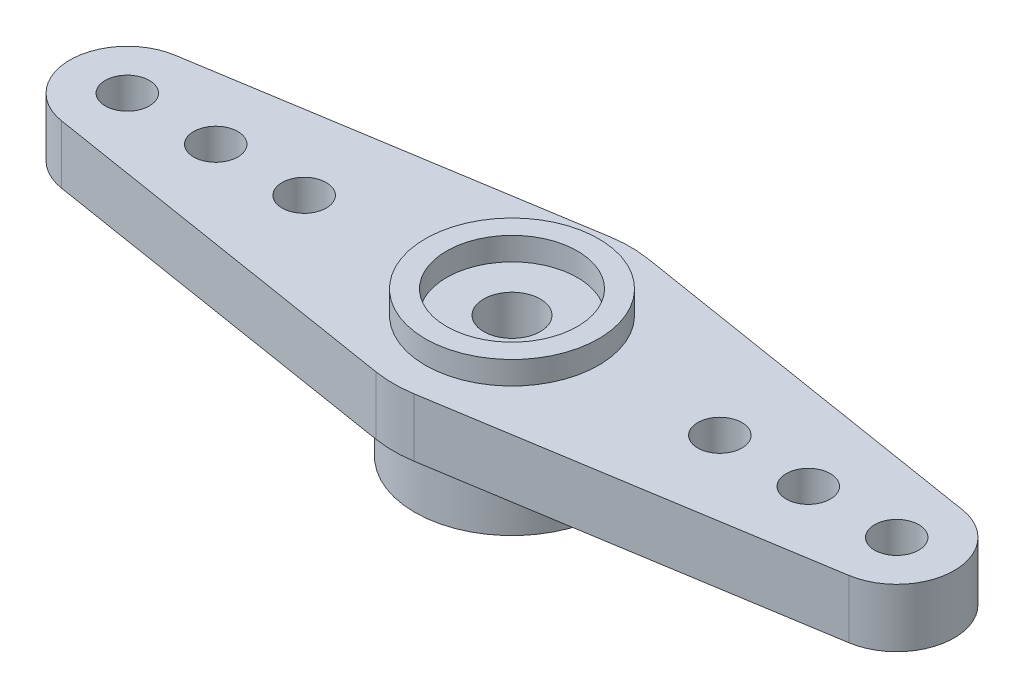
ISO-10303-21;
HEADER;
FILE_DESCRIPTION(('STEP AP214'),'2;1');
FILE_NAME('part.step','',(''),(''),'','','');
FILE_SCHEMA(('AUTOMOTIVE_DESIGN { 1 0 10303 214 1 1 1 1 }'));
ENDSEC;
DATA;
#1=APPLICATION_CONTEXT('core data for automotive mechanical design processes');
#2=APPLICATION_PROTOCOL_DEFINITION('international standard','automotive_design',2000,#1);
#3=PRODUCT_CONTEXT('',#1,'mechanical');
#4=PRODUCT('Part','Part','',(#3));
#5=PRODUCT_RELATED_PRODUCT_CATEGORY('part','',(#4));
#6=PRODUCT_DEFINITION_FORMATION('','',#4);
#7=PRODUCT_DEFINITION_CONTEXT('part definition',#1,'design');
#8=PRODUCT_DEFINITION('design','',#6,#7);
#9=PRODUCT_DEFINITION_SHAPE('','',#8);
#10=(LENGTH_UNIT() NAMED_UNIT(*) SI_UNIT(.MILLI.,.METRE.));
#11=(NAMED_UNIT(*) PLANE_ANGLE_UNIT() SI_UNIT($,.RADIAN.));
#12=(NAMED_UNIT(*) SI_UNIT($,.STERADIAN.) SOLID_ANGLE_UNIT());
#13=UNCERTAINTY_MEASURE_WITH_UNIT(LENGTH_MEASURE(1.E-05),#10,'distance_accuracy_value','');
#14=(GEOMETRIC_REPRESENTATION_CONTEXT(3) GLOBAL_UNCERTAINTY_ASSIGNED_CONTEXT((#13)) GLOBAL_UNIT_ASSIGNED_CONTEXT((#10,
#11,#12)) REPRESENTATION_CONTEXT('',''));
#15=CARTESIAN_POINT('',(0.,0.,0.));
#16=DIRECTION('',(0.,0.,1.));
#17=DIRECTION('',(1.,0.,0.));
#18=AXIS2_PLACEMENT_3D('',#15,#16,#17);
#19=CARTESIAN_POINT('',(0.,3.3,0.));
#20=DIRECTION('',(0.,1.,0.));
#21=DIRECTION('',(0.,0.,1.));
#22=AXIS2_PLACEMENT_3D('',#19,#20,#21);
#23=PLANE('',#22);
#24=CARTESIAN_POINT('',(-16.75,3.3,0.));
#25=DIRECTION('',(0.,1.,0.));
#26=DIRECTION('',(0.,0.,1.));
#27=AXIS2_PLACEMENT_3D('',#24,#25,#26);
#28=CIRCLE('',#27,1.25);
#29=CARTESIAN_POINT('',(-16.75,3.3,1.25));
#30=VERTEX_POINT('',#29);
#31=EDGE_CURVE('E195',#30,#30,#28,.T.);
#32=ORIENTED_EDGE('',*,*,#31,.F.);
#33=EDGE_LOOP('',(#32));
#34=FACE_BOUND('',#33,.T.);
#35=CARTESIAN_POINT('',(11.75,3.3,0.));
#36=DIRECTION('',(0.,1.,0.));
#37=DIRECTION('',(0.,0.,1.));
#38=AXIS2_PLACEMENT_3D('',#35,#36,#37);
#39=CIRCLE('',#38,1.25);
#40=CARTESIAN_POINT('',(11.75,3.3,1.25));
#41=VERTEX_POINT('',#40);
#42=EDGE_CURVE('E207',#41,#41,#39,.T.);
#43=ORIENTED_EDGE('',*,*,#42,.F.);
#44=EDGE_LOOP('',(#43));
#45=FACE_BOUND('',#44,.T.);
#46=CARTESIAN_POINT('',(21.75,3.3,0.));
#47=DIRECTION('',(0.,1.,0.));
#48=DIRECTION('',(0.,0.,1.));
#49=AXIS2_PLACEMENT_3D('',#46,#47,#48);
#50=CIRCLE('',#49,1.25);
#51=CARTESIAN_POINT('',(21.75,3.3,1.25));
#52=VERTEX_POINT('',#51);
#53=EDGE_CURVE('E219',#52,#52,#50,.T.);
#54=ORIENTED_EDGE('',*,*,#53,.F.);
#55=EDGE_LOOP('',(#54));
#56=FACE_BOUND('',#55,.T.);
#57=CARTESIAN_POINT('',(0.,3.3,0.));
#58=DIRECTION('',(0.,1.,0.));
#59=DIRECTION('',(0.,0.,1.));
#60=AXIS2_PLACEMENT_3D('',#57,#58,#59);
#61=CIRCLE('',#60,6.7);
#62=CARTESIAN_POINT('',(-1.06275862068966,3.3,6.61517528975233));
#63=VERTEX_POINT('',#62);
#64=CARTESIAN_POINT('',(1.06275862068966,3.3,6.61517528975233));
#65=VERTEX_POINT('',#64);
#66=EDGE_CURVE('E148',#63,#65,#61,.T.);
#67=ORIENTED_EDGE('',*,*,#66,.T.);
#68=DIRECTION('',(0.987339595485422,0.,-0.158620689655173));
#69=VECTOR('',#68,1.);
#70=CARTESIAN_POINT('',(1.06275862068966,3.3,6.61517528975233));
#71=LINE('',#70,#69);
#72=CARTESIAN_POINT('',(22.2655172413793,3.3,3.20885368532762));
#73=VERTEX_POINT('',#72);
#74=EDGE_CURVE('E96',#65,#73,#71,.T.);
#75=ORIENTED_EDGE('',*,*,#74,.T.);
#76=CARTESIAN_POINT('',(21.75,3.3,0.));
#77=DIRECTION('',(0.,1.,0.));
#78=DIRECTION('',(0.,0.,1.));
#79=AXIS2_PLACEMENT_3D('',#76,#77,#78);
#80=CIRCLE('',#79,3.25);
#81=CARTESIAN_POINT('',(22.2655172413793,3.3,-3.20885368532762));
#82=VERTEX_POINT('',#81);
#83=EDGE_CURVE('E228',#73,#82,#80,.T.);
#84=ORIENTED_EDGE('',*,*,#83,.T.);
#85=DIRECTION('',(-0.987339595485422,0.,-0.158620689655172));
#86=VECTOR('',#85,1.);
#87=CARTESIAN_POINT('',(22.2655172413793,3.3,-3.20885368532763));
#88=LINE('',#87,#86);
#89=CARTESIAN_POINT('',(1.06275862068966,3.3,-6.61517528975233));
#90=VERTEX_POINT('',#89);
#91=EDGE_CURVE('E230',#82,#90,#88,.T.);
#92=ORIENTED_EDGE('',*,*,#91,.T.);
#93=CARTESIAN_POINT('',(0.,3.3,0.));
#94=DIRECTION('',(0.,1.,0.));
#95=DIRECTION('',(0.,0.,1.));
#96=AXIS2_PLACEMENT_3D('',#93,#94,#95);
#97=CIRCLE('',#96,6.7);
#98=CARTESIAN_POINT('',(-1.06275862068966,3.3,-6.61517528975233));
#99=VERTEX_POINT('',#98);
#100=EDGE_CURVE('E115',#90,#99,#97,.T.);
#101=ORIENTED_EDGE('',*,*,#100,.T.);
#102=DIRECTION('',(-0.987339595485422,0.,0.158620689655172));
#103=VECTOR('',#102,1.);
#104=CARTESIAN_POINT('',(-22.2655172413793,3.3,-3.20885368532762));
#105=LINE('',#104,#103);
#106=CARTESIAN_POINT('',(-22.2655172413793,3.3,-3.20885368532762));
#107=VERTEX_POINT('',#106);
#108=EDGE_CURVE('E109',#99,#107,#105,.T.);
#109=ORIENTED_EDGE('',*,*,#108,.T.);
#110=CARTESIAN_POINT('',(-21.75,3.3,0.));
#111=DIRECTION('',(0.,1.,0.));
#112=DIRECTION('',(0.,0.,1.));
#113=AXIS2_PLACEMENT_3D('',#110,#111,#112);
#114=CIRCLE('',#113,3.25);
#115=CARTESIAN_POINT('',(-22.2655172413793,3.3,3.20885368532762));
#116=VERTEX_POINT('',#115);
#117=EDGE_CURVE('E113',#107,#116,#114,.T.);
#118=ORIENTED_EDGE('',*,*,#117,.T.);
#119=DIRECTION('',(0.987339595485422,0.,0.158620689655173));
#120=VECTOR('',#119,1.);
#121=CARTESIAN_POINT('',(-1.06275862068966,3.3,6.61517528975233));
#122=LINE('',#121,#120);
#123=EDGE_CURVE('E52',#116,#63,#122,.T.);
#124=ORIENTED_EDGE('',*,*,#123,.T.);
#125=EDGE_LOOP('',(#67,#75,#84,#92,#101,#109,#118,#124));
#126=FACE_BOUND('',#125,.T.);
#127=CARTESIAN_POINT('',(16.75,3.3,0.));
#128=DIRECTION('',(0.,1.,0.));
#129=DIRECTION('',(0.,0.,1.));
#130=AXIS2_PLACEMENT_3D('',#127,#128,#129);
#131=CIRCLE('',#130,1.25);
#132=CARTESIAN_POINT('',(16.75,3.3,1.25));
#133=VERTEX_POINT('',#132);
#134=EDGE_CURVE('E213',#133,#133,#131,.T.);
#135=ORIENTED_EDGE('',*,*,#134,.F.);
#136=EDGE_LOOP('',(#135));
#137=FACE_BOUND('',#136,.T.);
#138=CARTESIAN_POINT('',(-21.75,3.3,0.));
#139=DIRECTION('',(0.,1.,0.));
#140=DIRECTION('',(0.,0.,1.));
#141=AXIS2_PLACEMENT_3D('',#138,#139,#140);
#142=CIRCLE('',#141,1.25);
#143=CARTESIAN_POINT('',(-21.75,3.3,1.25));
#144=VERTEX_POINT('',#143);
#145=EDGE_CURVE('E201',#144,#144,#142,.T.);
#146=ORIENTED_EDGE('',*,*,#145,.F.);
#147=EDGE_LOOP('',(#146));
#148=FACE_BOUND('',#147,.T.);
#149=CARTESIAN_POINT('',(-11.75,3.3,0.));
#150=DIRECTION('',(0.,1.,0.));
#151=DIRECTION('',(0.,0.,1.));
#152=AXIS2_PLACEMENT_3D('',#149,#150,#151);
#153=CIRCLE('',#152,1.25);
#154=CARTESIAN_POINT('',(-11.75,3.3,1.25));
#155=VERTEX_POINT('',#154);
#156=EDGE_CURVE('E189',#155,#155,#153,.T.);
#157=ORIENTED_EDGE('',*,*,#156,.F.);
#158=EDGE_LOOP('',(#157));
#159=FACE_BOUND('',#158,.T.);
#160=CARTESIAN_POINT('',(0.,3.3,0.));
#161=DIRECTION('',(0.,1.,0.));
#162=DIRECTION('',(0.,0.,1.));
#163=AXIS2_PLACEMENT_3D('',#160,#161,#162);
#164=CIRCLE('',#163,4.9);
#165=CARTESIAN_POINT('',(0.,3.3,4.9));
#166=VERTEX_POINT('',#165);
#167=EDGE_CURVE('E174',#166,#166,#164,.T.);
#168=ORIENTED_EDGE('',*,*,#167,.F.);
#169=EDGE_LOOP('',(#168));
#170=FACE_BOUND('',#169,.T.);
#171=ADVANCED_FACE('F35',(#34,#45,#56,#126,#137,#148,#159,#170),#23,.T.);
#172=CARTESIAN_POINT('',(0.,0.,0.));
#173=DIRECTION('',(0.,1.,0.));
#174=DIRECTION('',(0.,0.,1.));
#175=AXIS2_PLACEMENT_3D('',#172,#173,#174);
#176=PLANE('',#175);
#177=CARTESIAN_POINT('',(-11.75,0.,0.));
#178=DIRECTION('',(0.,1.,0.));
#179=DIRECTION('',(0.,0.,1.));
#180=AXIS2_PLACEMENT_3D('',#177,#178,#179);
#181=CIRCLE('',#180,1.25);
#182=CARTESIAN_POINT('',(-11.75,0.,1.25));
#183=VERTEX_POINT('',#182);
#184=EDGE_CURVE('E188',#183,#183,#181,.T.);
#185=ORIENTED_EDGE('',*,*,#184,.T.);
#186=EDGE_LOOP('',(#185));
#187=FACE_BOUND('',#186,.T.);
#188=CARTESIAN_POINT('',(-21.75,0.,0.));
#189=DIRECTION('',(0.,1.,0.));
#190=DIRECTION('',(0.,0.,1.));
#191=AXIS2_PLACEMENT_3D('',#188,#189,#190);
#192=CIRCLE('',#191,1.25);
#193=CARTESIAN_POINT('',(-21.75,0.,1.25));
#194=VERTEX_POINT('',#193);
#195=EDGE_CURVE('E198',#194,#194,#192,.T.);
#196=ORIENTED_EDGE('',*,*,#195,.T.);
#197=EDGE_LOOP('',(#196));
#198=FACE_BOUND('',#197,.T.);
#199=CARTESIAN_POINT('',(16.75,0.,0.));
#200=DIRECTION('',(0.,1.,0.));
#201=DIRECTION('',(0.,0.,1.));
#202=AXIS2_PLACEMENT_3D('',#199,#200,#201);
#203=CIRCLE('',#202,1.25);
#204=CARTESIAN_POINT('',(16.75,0.,1.25));
#205=VERTEX_POINT('',#204);
#206=EDGE_CURVE('E210',#205,#205,#203,.T.);
#207=ORIENTED_EDGE('',*,*,#206,.T.);
#208=EDGE_LOOP('',(#207));
#209=FACE_BOUND('',#208,.T.);
#210=CARTESIAN_POINT('',(0.,0.,0.));
#211=DIRECTION('',(0.,1.,0.));
#212=DIRECTION('',(0.,0.,1.));
#213=AXIS2_PLACEMENT_3D('',#210,#211,#212);
#214=CIRCLE('',#213,6.7);
#215=CARTESIAN_POINT('',(-1.06275862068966,0.,6.61517528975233));
#216=VERTEX_POINT('',#215);
#217=CARTESIAN_POINT('',(1.06275862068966,0.,6.61517528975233));
#218=VERTEX_POINT('',#217);
#219=EDGE_CURVE('E133',#216,#218,#214,.T.);
#220=ORIENTED_EDGE('',*,*,#219,.F.);
#221=DIRECTION('',(0.987339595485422,0.,0.158620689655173));
#222=VECTOR('',#221,1.);
#223=CARTESIAN_POINT('',(-1.06275862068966,0.,6.61517528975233));
#224=LINE('',#223,#222);
#225=CARTESIAN_POINT('',(-22.2655172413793,0.,3.20885368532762));
#226=VERTEX_POINT('',#225);
#227=EDGE_CURVE('E87',#226,#216,#224,.T.);
#228=ORIENTED_EDGE('',*,*,#227,.F.);
#229=CARTESIAN_POINT('',(-21.75,0.,0.));
#230=DIRECTION('',(0.,1.,0.));
#231=DIRECTION('',(0.,0.,1.));
#232=AXIS2_PLACEMENT_3D('',#229,#230,#231);
#233=CIRCLE('',#232,3.25);
#234=CARTESIAN_POINT('',(-22.2655172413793,0.,-3.20885368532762));
#235=VERTEX_POINT('',#234);
#236=EDGE_CURVE('E81',#235,#226,#233,.T.);
#237=ORIENTED_EDGE('',*,*,#236,.F.);
#238=DIRECTION('',(-0.987339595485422,0.,0.158620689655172));
#239=VECTOR('',#238,1.);
#240=CARTESIAN_POINT('',(-22.2655172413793,0.,-3.20885368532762));
#241=LINE('',#240,#239);
#242=CARTESIAN_POINT('',(-1.06275862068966,0.,-6.61517528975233));
#243=VERTEX_POINT('',#242);
#244=EDGE_CURVE('E123',#243,#235,#241,.T.);
#245=ORIENTED_EDGE('',*,*,#244,.F.);
#246=CARTESIAN_POINT('',(0.,0.,0.));
#247=DIRECTION('',(0.,1.,0.));
#248=DIRECTION('',(0.,0.,1.));
#249=AXIS2_PLACEMENT_3D('',#246,#247,#248);
#250=CIRCLE('',#249,6.7);
#251=CARTESIAN_POINT('',(1.06275862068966,0.,-6.61517528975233));
#252=VERTEX_POINT('',#251);
#253=EDGE_CURVE('E143',#252,#243,#250,.T.);
#254=ORIENTED_EDGE('',*,*,#253,.F.);
#255=DIRECTION('',(-0.987339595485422,0.,-0.158620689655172));
#256=VECTOR('',#255,1.);
#257=CARTESIAN_POINT('',(22.2655172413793,0.,-3.20885368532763));
#258=LINE('',#257,#256);
#259=CARTESIAN_POINT('',(22.2655172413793,0.,-3.20885368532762));
#260=VERTEX_POINT('',#259);
#261=EDGE_CURVE('E141',#260,#252,#258,.T.);
#262=ORIENTED_EDGE('',*,*,#261,.F.);
#263=CARTESIAN_POINT('',(21.75,0.,0.));
#264=DIRECTION('',(0.,1.,0.));
#265=DIRECTION('',(0.,0.,1.));
#266=AXIS2_PLACEMENT_3D('',#263,#264,#265);
#267=CIRCLE('',#266,3.25);
#268=CARTESIAN_POINT('',(22.2655172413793,0.,3.20885368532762));
#269=VERTEX_POINT('',#268);
#270=EDGE_CURVE('E139',#269,#260,#267,.T.);
#271=ORIENTED_EDGE('',*,*,#270,.F.);
#272=DIRECTION('',(0.987339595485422,0.,-0.158620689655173));
#273=VECTOR('',#272,1.);
#274=CARTESIAN_POINT('',(1.06275862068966,0.,6.61517528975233));
#275=LINE('',#274,#273);
#276=EDGE_CURVE('E136',#218,#269,#275,.T.);
#277=ORIENTED_EDGE('',*,*,#276,.F.);
#278=EDGE_LOOP('',(#220,#228,#237,#245,#254,#262,#271,#277));
#279=FACE_BOUND('',#278,.T.);
#280=CARTESIAN_POINT('',(21.75,0.,0.));
#281=DIRECTION('',(0.,1.,0.));
#282=DIRECTION('',(0.,0.,1.));
#283=AXIS2_PLACEMENT_3D('',#280,#281,#282);
#284=CIRCLE('',#283,1.25);
#285=CARTESIAN_POINT('',(21.75,0.,1.25));
#286=VERTEX_POINT('',#285);
#287=EDGE_CURVE('E216',#286,#286,#284,.T.);
#288=ORIENTED_EDGE('',*,*,#287,.T.);
#289=EDGE_LOOP('',(#288));
#290=FACE_BOUND('',#289,.T.);
#291=CARTESIAN_POINT('',(11.75,0.,0.));
#292=DIRECTION('',(0.,1.,0.));
#293=DIRECTION('',(0.,0.,1.));
#294=AXIS2_PLACEMENT_3D('',#291,#292,#293);
#295=CIRCLE('',#294,1.25);
#296=CARTESIAN_POINT('',(11.75,0.,1.25));
#297=VERTEX_POINT('',#296);
#298=EDGE_CURVE('E204',#297,#297,#295,.T.);
#299=ORIENTED_EDGE('',*,*,#298,.T.);
#300=EDGE_LOOP('',(#299));
#301=FACE_BOUND('',#300,.T.);
#302=CARTESIAN_POINT('',(-16.75,0.,0.));
#303=DIRECTION('',(0.,1.,0.));
#304=DIRECTION('',(0.,0.,1.));
#305=AXIS2_PLACEMENT_3D('',#302,#303,#304);
#306=CIRCLE('',#305,1.25);
#307=CARTESIAN_POINT('',(-16.75,0.,1.25));
#308=VERTEX_POINT('',#307);
#309=EDGE_CURVE('E192',#308,#308,#306,.T.);
#310=ORIENTED_EDGE('',*,*,#309,.T.);
#311=EDGE_LOOP('',(#310));
#312=FACE_BOUND('',#311,.T.);
#313=CARTESIAN_POINT('',(0.,0.,0.));
#314=DIRECTION('',(0.,1.,0.));
#315=DIRECTION('',(0.,0.,1.));
#316=AXIS2_PLACEMENT_3D('',#313,#314,#315);
#317=CIRCLE('',#316,5.5);
#318=CARTESIAN_POINT('',(0.,0.,5.5));
#319=VERTEX_POINT('',#318);
#320=EDGE_CURVE('E44',#319,#319,#317,.F.);
#321=ORIENTED_EDGE('',*,*,#320,.F.);
#322=EDGE_LOOP('',(#321));
#323=FACE_BOUND('',#322,.T.);
#324=ADVANCED_FACE('F243',(#187,#198,#209,#279,#290,#301,#312,#323),#176,.F.);
#325=CARTESIAN_POINT('',(0.,3.3,0.));
#326=DIRECTION('',(0.,1.,0.));
#327=DIRECTION('',(0.,0.,1.));
#328=AXIS2_PLACEMENT_3D('',#325,#326,#327);
#329=CIRCLE('',#328,3.7);
#330=CARTESIAN_POINT('',(0.,3.3,3.7));
#331=VERTEX_POINT('',#330);
#332=EDGE_CURVE('E11',#331,#331,#329,.F.);
#333=ORIENTED_EDGE('',*,*,#332,.F.);
#334=EDGE_LOOP('',(#333));
#335=FACE_BOUND('',#334,.T.);
#336=CARTESIAN_POINT('',(0.,3.3,0.));
#337=DIRECTION('',(0.,1.,0.));
#338=DIRECTION('',(0.,0.,1.));
#339=AXIS2_PLACEMENT_3D('',#336,#337,#338);
#340=CIRCLE('',#339,1.6);
#341=CARTESIAN_POINT('',(0.,3.3,1.6));
#342=VERTEX_POINT('',#341);
#343=EDGE_CURVE('E137',#342,#342,#340,.T.);
#344=ORIENTED_EDGE('',*,*,#343,.F.);
#345=EDGE_LOOP('',(#344));
#346=FACE_BOUND('',#345,.T.);
#347=ADVANCED_FACE('F265',(#335,#346),#23,.T.);
#348=CARTESIAN_POINT('',(0.,3.3,0.));
#349=DIRECTION('',(0.,-1.,0.));
#350=DIRECTION('',(0.,0.,-1.));
#351=AXIS2_PLACEMENT_3D('',#348,#349,#350);
#352=CYLINDRICAL_SURFACE('',#351,6.7);
#353=ORIENTED_EDGE('',*,*,#219,.T.);
#354=DIRECTION('',(0.,-1.,0.));
#355=VECTOR('',#354,1.);
#356=CARTESIAN_POINT('',(1.06275862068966,3.3,6.61517528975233));
#357=LINE('',#356,#355);
#358=EDGE_CURVE('E161',#65,#218,#357,.T.);
#359=ORIENTED_EDGE('',*,*,#358,.F.);
#360=ORIENTED_EDGE('',*,*,#66,.F.);
#361=DIRECTION('',(0.,-1.,0.));
#362=VECTOR('',#361,1.);
#363=CARTESIAN_POINT('',(-1.06275862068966,3.3,6.61517528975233));
#364=LINE('',#363,#362);
#365=EDGE_CURVE('E129',#63,#216,#364,.T.);
#366=ORIENTED_EDGE('',*,*,#365,.T.);
#367=EDGE_LOOP('',(#353,#359,#360,#366));
#368=FACE_BOUND('',#367,.T.);
#369=ADVANCED_FACE('F37',(#368),#352,.T.);
#370=CARTESIAN_POINT('',(1.06275862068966,3.3,6.61517528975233));
#371=DIRECTION('',(-0.158620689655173,0.,-0.987339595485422));
#372=DIRECTION('',(-0.987339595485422,0.,0.158620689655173));
#373=AXIS2_PLACEMENT_3D('',#370,#371,#372);
#374=PLANE('',#373);
#375=ORIENTED_EDGE('',*,*,#276,.T.);
#376=DIRECTION('',(0.,-1.,0.));
#377=VECTOR('',#376,1.);
#378=CARTESIAN_POINT('',(22.2655172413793,3.3,3.20885368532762));
#379=LINE('',#378,#377);
#380=EDGE_CURVE('E158',#73,#269,#379,.T.);
#381=ORIENTED_EDGE('',*,*,#380,.F.);
#382=ORIENTED_EDGE('',*,*,#74,.F.);
#383=ORIENTED_EDGE('',*,*,#358,.T.);
#384=EDGE_LOOP('',(#375,#381,#382,#383));
#385=FACE_BOUND('',#384,.T.);
#386=ADVANCED_FACE('F277',(#385),#374,.F.);
#387=CARTESIAN_POINT('',(21.75,3.3,0.));
#388=DIRECTION('',(0.,-1.,0.));
#389=DIRECTION('',(0.,0.,-1.));
#390=AXIS2_PLACEMENT_3D('',#387,#388,#389);
#391=CYLINDRICAL_SURFACE('',#390,3.25);
#392=ORIENTED_EDGE('',*,*,#270,.T.);
#393=DIRECTION('',(0.,-1.,0.));
#394=VECTOR('',#393,1.);
#395=CARTESIAN_POINT('',(22.2655172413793,3.3,-3.20885368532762));
#396=LINE('',#395,#394);
#397=EDGE_CURVE('E155',#82,#260,#396,.T.);
#398=ORIENTED_EDGE('',*,*,#397,.F.);
#399=ORIENTED_EDGE('',*,*,#83,.F.);
#400=ORIENTED_EDGE('',*,*,#380,.T.);
#401=EDGE_LOOP('',(#392,#398,#399,#400));
#402=FACE_BOUND('',#401,.T.);
#403=ADVANCED_FACE('F472',(#402),#391,.T.);
#404=CARTESIAN_POINT('',(22.2655172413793,3.3,-3.20885368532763));
#405=DIRECTION('',(-0.158620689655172,0.,0.987339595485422));
#406=DIRECTION('',(0.987339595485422,0.,0.158620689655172));
#407=AXIS2_PLACEMENT_3D('',#404,#405,#406);
#408=PLANE('',#407);
#409=ORIENTED_EDGE('',*,*,#261,.T.);
#410=DIRECTION('',(0.,-1.,0.));
#411=VECTOR('',#410,1.);
#412=CARTESIAN_POINT('',(1.06275862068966,3.3,-6.61517528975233));
#413=LINE('',#412,#411);
#414=EDGE_CURVE('E152',#90,#252,#413,.T.);
#415=ORIENTED_EDGE('',*,*,#414,.F.);
#416=ORIENTED_EDGE('',*,*,#91,.F.);
#417=ORIENTED_EDGE('',*,*,#397,.T.);
#418=EDGE_LOOP('',(#409,#415,#416,#417));
#419=FACE_BOUND('',#418,.T.);
#420=ADVANCED_FACE('F236',(#419),#408,.F.);
#421=CARTESIAN_POINT('',(0.,3.3,0.));
#422=DIRECTION('',(0.,-1.,0.));
#423=DIRECTION('',(0.,0.,-1.));
#424=AXIS2_PLACEMENT_3D('',#421,#422,#423);
#425=CYLINDRICAL_SURFACE('',#424,6.7);
#426=ORIENTED_EDGE('',*,*,#253,.T.);
#427=DIRECTION('',(0.,-1.,0.));
#428=VECTOR('',#427,1.);
#429=CARTESIAN_POINT('',(-1.06275862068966,3.3,-6.61517528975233));
#430=LINE('',#429,#428);
#431=EDGE_CURVE('E124',#99,#243,#430,.T.);
#432=ORIENTED_EDGE('',*,*,#431,.F.);
#433=ORIENTED_EDGE('',*,*,#100,.F.);
#434=ORIENTED_EDGE('',*,*,#414,.T.);
#435=EDGE_LOOP('',(#426,#432,#433,#434));
#436=FACE_BOUND('',#435,.T.);
#437=ADVANCED_FACE('F240',(#436),#425,.T.);
#438=CARTESIAN_POINT('',(-22.2655172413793,3.3,-3.20885368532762));
#439=DIRECTION('',(0.158620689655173,0.,0.987339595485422));
#440=DIRECTION('',(0.987339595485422,0.,-0.158620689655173));
#441=AXIS2_PLACEMENT_3D('',#438,#439,#440);
#442=PLANE('',#441);
#443=ORIENTED_EDGE('',*,*,#244,.T.);
#444=DIRECTION('',(0.,-1.,0.));
#445=VECTOR('',#444,1.);
#446=CARTESIAN_POINT('',(-22.2655172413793,3.3,-3.20885368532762));
#447=LINE('',#446,#445);
#448=EDGE_CURVE('E120',#107,#235,#447,.T.);
#449=ORIENTED_EDGE('',*,*,#448,.F.);
#450=ORIENTED_EDGE('',*,*,#108,.F.);
#451=ORIENTED_EDGE('',*,*,#431,.T.);
#452=EDGE_LOOP('',(#443,#449,#450,#451));
#453=FACE_BOUND('',#452,.T.);
#454=ADVANCED_FACE('F121',(#453),#442,.F.);
#455=CARTESIAN_POINT('',(-21.75,3.3,0.));
#456=DIRECTION('',(0.,-1.,0.));
#457=DIRECTION('',(0.,0.,-1.));
#458=AXIS2_PLACEMENT_3D('',#455,#456,#457);
#459=CYLINDRICAL_SURFACE('',#458,3.25);
#460=ORIENTED_EDGE('',*,*,#236,.T.);
#461=DIRECTION('',(0.,-1.,0.));
#462=VECTOR('',#461,1.);
#463=CARTESIAN_POINT('',(-22.2655172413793,3.3,3.20885368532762));
#464=LINE('',#463,#462);
#465=EDGE_CURVE('E125',#116,#226,#464,.T.);
#466=ORIENTED_EDGE('',*,*,#465,.F.);
#467=ORIENTED_EDGE('',*,*,#117,.F.);
#468=ORIENTED_EDGE('',*,*,#448,.T.);
#469=EDGE_LOOP('',(#460,#466,#467,#468));
#470=FACE_BOUND('',#469,.T.);
#471=ADVANCED_FACE('F127',(#470),#459,.T.);
#472=CARTESIAN_POINT('',(-1.06275862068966,3.3,6.61517528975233));
#473=DIRECTION('',(0.158620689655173,0.,-0.987339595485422));
#474=DIRECTION('',(-0.987339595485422,0.,-0.158620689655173));
#475=AXIS2_PLACEMENT_3D('',#472,#473,#474);
#476=PLANE('',#475);
#477=ORIENTED_EDGE('',*,*,#227,.T.);
#478=ORIENTED_EDGE('',*,*,#365,.F.);
#479=ORIENTED_EDGE('',*,*,#123,.F.);
#480=ORIENTED_EDGE('',*,*,#465,.T.);
#481=EDGE_LOOP('',(#477,#478,#479,#480));
#482=FACE_BOUND('',#481,.T.);
#483=ADVANCED_FACE('F249',(#482),#476,.F.);
#484=CARTESIAN_POINT('',(0.,3.3,0.));
#485=DIRECTION('',(0.,-1.,0.));
#486=DIRECTION('',(0.,0.,-1.));
#487=AXIS2_PLACEMENT_3D('',#484,#485,#486);
#488=CYLINDRICAL_SURFACE('',#487,1.6);
#489=ORIENTED_EDGE('',*,*,#343,.T.);
#490=EDGE_LOOP('',(#489));
#491=FACE_BOUND('',#490,.T.);
#492=CARTESIAN_POINT('',(0.,-0.2,0.));
#493=DIRECTION('',(0.,-1.,0.));
#494=DIRECTION('',(0.,0.,-1.));
#495=AXIS2_PLACEMENT_3D('',#492,#493,#494);
#496=CIRCLE('',#495,1.6);
#497=CARTESIAN_POINT('',(0.,-0.2,-1.6));
#498=VERTEX_POINT('',#497);
#499=EDGE_CURVE('E164',#498,#498,#496,.T.);
#500=ORIENTED_EDGE('',*,*,#499,.T.);
#501=EDGE_LOOP('',(#500));
#502=FACE_BOUND('',#501,.T.);
#503=ADVANCED_FACE('F251',(#491,#502),#488,.F.);
#504=CARTESIAN_POINT('',(21.75,3.3,0.));
#505=DIRECTION('',(0.,-1.,0.));
#506=DIRECTION('',(0.,0.,-1.));
#507=AXIS2_PLACEMENT_3D('',#504,#505,#506);
#508=CYLINDRICAL_SURFACE('',#507,1.25);
#509=ORIENTED_EDGE('',*,*,#53,.T.);
#510=EDGE_LOOP('',(#509));
#511=FACE_BOUND('',#510,.T.);
#512=ORIENTED_EDGE('',*,*,#287,.F.);
#513=EDGE_LOOP('',(#512));
#514=FACE_BOUND('',#513,.T.);
#515=ADVANCED_FACE('F257',(#511,#514),#508,.F.);
#516=CARTESIAN_POINT('',(16.75,3.3,0.));
#517=DIRECTION('',(0.,-1.,0.));
#518=DIRECTION('',(0.,0.,-1.));
#519=AXIS2_PLACEMENT_3D('',#516,#517,#518);
#520=CYLINDRICAL_SURFACE('',#519,1.25);
#521=ORIENTED_EDGE('',*,*,#134,.T.);
#522=EDGE_LOOP('',(#521));
#523=FACE_BOUND('',#522,.T.);
#524=ORIENTED_EDGE('',*,*,#206,.F.);
#525=EDGE_LOOP('',(#524));
#526=FACE_BOUND('',#525,.T.);
#527=ADVANCED_FACE('F328',(#523,#526),#520,.F.);
#528=CARTESIAN_POINT('',(11.75,3.3,0.));
#529=DIRECTION('',(0.,-1.,0.));
#530=DIRECTION('',(0.,0.,-1.));
#531=AXIS2_PLACEMENT_3D('',#528,#529,#530);
#532=CYLINDRICAL_SURFACE('',#531,1.25);
#533=ORIENTED_EDGE('',*,*,#42,.T.);
#534=EDGE_LOOP('',(#533));
#535=FACE_BOUND('',#534,.T.);
#536=ORIENTED_EDGE('',*,*,#298,.F.);
#537=EDGE_LOOP('',(#536));
#538=FACE_BOUND('',#537,.T.);
#539=ADVANCED_FACE('F324',(#535,#538),#532,.F.);
#540=CARTESIAN_POINT('',(-21.75,3.3,0.));
#541=DIRECTION('',(0.,-1.,0.));
#542=DIRECTION('',(0.,0.,-1.));
#543=AXIS2_PLACEMENT_3D('',#540,#541,#542);
#544=CYLINDRICAL_SURFACE('',#543,1.25);
#545=ORIENTED_EDGE('',*,*,#145,.T.);
#546=EDGE_LOOP('',(#545));
#547=FACE_BOUND('',#546,.T.);
#548=ORIENTED_EDGE('',*,*,#195,.F.);
#549=EDGE_LOOP('',(#548));
#550=FACE_BOUND('',#549,.T.);
#551=ADVANCED_FACE('F320',(#547,#550),#544,.F.);
#552=CARTESIAN_POINT('',(-16.75,3.3,0.));
#553=DIRECTION('',(0.,-1.,0.));
#554=DIRECTION('',(0.,0.,-1.));
#555=AXIS2_PLACEMENT_3D('',#552,#553,#554);
#556=CYLINDRICAL_SURFACE('',#555,1.25);
#557=ORIENTED_EDGE('',*,*,#31,.T.);
#558=EDGE_LOOP('',(#557));
#559=FACE_BOUND('',#558,.T.);
#560=ORIENTED_EDGE('',*,*,#309,.F.);
#561=EDGE_LOOP('',(#560));
#562=FACE_BOUND('',#561,.T.);
#563=ADVANCED_FACE('F316',(#559,#562),#556,.F.);
#564=CARTESIAN_POINT('',(-11.75,3.3,0.));
#565=DIRECTION('',(0.,-1.,0.));
#566=DIRECTION('',(0.,0.,-1.));
#567=AXIS2_PLACEMENT_3D('',#564,#565,#566);
#568=CYLINDRICAL_SURFACE('',#567,1.25);
#569=ORIENTED_EDGE('',*,*,#156,.T.);
#570=EDGE_LOOP('',(#569));
#571=FACE_BOUND('',#570,.T.);
#572=ORIENTED_EDGE('',*,*,#184,.F.);
#573=EDGE_LOOP('',(#572));
#574=FACE_BOUND('',#573,.T.);
#575=ADVANCED_FACE('F312',(#571,#574),#568,.F.);
#576=CARTESIAN_POINT('',(0.,-3.6,0.));
#577=DIRECTION('',(0.,1.,0.));
#578=DIRECTION('',(0.,0.,1.));
#579=AXIS2_PLACEMENT_3D('',#576,#577,#578);
#580=CYLINDRICAL_SURFACE('',#579,5.5);
#581=CARTESIAN_POINT('',(0.,-3.6,0.));
#582=DIRECTION('',(0.,-1.,0.));
#583=DIRECTION('',(0.,0.,-1.));
#584=AXIS2_PLACEMENT_3D('',#581,#582,#583);
#585=CIRCLE('',#584,5.5);
#586=CARTESIAN_POINT('',(0.,-3.6,-5.5));
#587=VERTEX_POINT('',#586);
#588=EDGE_CURVE('E184',#587,#587,#585,.T.);
#589=ORIENTED_EDGE('',*,*,#588,.F.);
#590=EDGE_LOOP('',(#589));
#591=FACE_BOUND('',#590,.T.);
#592=ORIENTED_EDGE('',*,*,#320,.T.);
#593=EDGE_LOOP('',(#592));
#594=FACE_BOUND('',#593,.T.);
#595=ADVANCED_FACE('F308',(#591,#594),#580,.T.);
#596=CARTESIAN_POINT('',(0.,-3.6,0.));
#597=DIRECTION('',(0.,-1.,0.));
#598=DIRECTION('',(0.,0.,-1.));
#599=AXIS2_PLACEMENT_3D('',#596,#597,#598);
#600=PLANE('',#599);
#601=CARTESIAN_POINT('',(0.,-3.6,0.));
#602=DIRECTION('',(0.,-1.,0.));
#603=DIRECTION('',(0.,0.,-1.));
#604=AXIS2_PLACEMENT_3D('',#601,#602,#603);
#605=CIRCLE('',#604,3.);
#606=CARTESIAN_POINT('',(0.,-3.6,-3.));
#607=VERTEX_POINT('',#606);
#608=EDGE_CURVE('E166',#607,#607,#605,.T.);
#609=ORIENTED_EDGE('',*,*,#608,.F.);
#610=EDGE_LOOP('',(#609));
#611=FACE_BOUND('',#610,.T.);
#612=ORIENTED_EDGE('',*,*,#588,.T.);
#613=EDGE_LOOP('',(#612));
#614=FACE_BOUND('',#613,.T.);
#615=ADVANCED_FACE('F304',(#611,#614),#600,.T.);
#616=CARTESIAN_POINT('',(0.,-0.2,0.));
#617=DIRECTION('',(0.,-1.,0.));
#618=DIRECTION('',(0.,0.,-1.));
#619=AXIS2_PLACEMENT_3D('',#616,#617,#618);
#620=CYLINDRICAL_SURFACE('',#619,3.);
#621=CARTESIAN_POINT('',(0.,-0.2,0.));
#622=DIRECTION('',(0.,-1.,0.));
#623=DIRECTION('',(0.,0.,-1.));
#624=AXIS2_PLACEMENT_3D('',#621,#622,#623);
#625=CIRCLE('',#624,3.);
#626=CARTESIAN_POINT('',(0.,-0.2,-3.));
#627=VERTEX_POINT('',#626);
#628=EDGE_CURVE('E171',#627,#627,#625,.T.);
#629=ORIENTED_EDGE('',*,*,#628,.F.);
#630=EDGE_LOOP('',(#629));
#631=FACE_BOUND('',#630,.T.);
#632=ORIENTED_EDGE('',*,*,#608,.T.);
#633=EDGE_LOOP('',(#632));
#634=FACE_BOUND('',#633,.T.);
#635=ADVANCED_FACE('F300',(#631,#634),#620,.F.);
#636=CARTESIAN_POINT('',(0.,-0.2,0.));
#637=DIRECTION('',(0.,-1.,0.));
#638=DIRECTION('',(0.,0.,-1.));
#639=AXIS2_PLACEMENT_3D('',#636,#637,#638);
#640=PLANE('',#639);
#641=ORIENTED_EDGE('',*,*,#499,.F.);
#642=EDGE_LOOP('',(#641));
#643=FACE_BOUND('',#642,.T.);
#644=ORIENTED_EDGE('',*,*,#628,.T.);
#645=EDGE_LOOP('',(#644));
#646=FACE_BOUND('',#645,.T.);
#647=ADVANCED_FACE('F296',(#643,#646),#640,.T.);
#648=CARTESIAN_POINT('',(0.,4.6,0.));
#649=DIRECTION('',(0.,1.,0.));
#650=DIRECTION('',(0.,0.,1.));
#651=AXIS2_PLACEMENT_3D('',#648,#649,#650);
#652=PLANE('',#651);
#653=CARTESIAN_POINT('',(0.,4.6,0.));
#654=DIRECTION('',(0.,1.,0.));
#655=DIRECTION('',(0.,0.,1.));
#656=AXIS2_PLACEMENT_3D('',#653,#654,#655);
#657=CIRCLE('',#656,4.9);
#658=CARTESIAN_POINT('',(0.,4.6,4.9));
#659=VERTEX_POINT('',#658);
#660=EDGE_CURVE('E167',#659,#659,#657,.T.);
#661=ORIENTED_EDGE('',*,*,#660,.T.);
#662=EDGE_LOOP('',(#661));
#663=FACE_BOUND('',#662,.T.);
#664=CARTESIAN_POINT('',(0.,4.6,0.));
#665=DIRECTION('',(0.,1.,0.));
#666=DIRECTION('',(0.,0.,1.));
#667=AXIS2_PLACEMENT_3D('',#664,#665,#666);
#668=CIRCLE('',#667,3.7);
#669=CARTESIAN_POINT('',(0.,4.6,3.7));
#670=VERTEX_POINT('',#669);
#671=EDGE_CURVE('E179',#670,#670,#668,.T.);
#672=ORIENTED_EDGE('',*,*,#671,.F.);
#673=EDGE_LOOP('',(#672));
#674=FACE_BOUND('',#673,.T.);
#675=ADVANCED_FACE('F290',(#663,#674),#652,.T.);
#676=CARTESIAN_POINT('',(0.,4.6,0.));
#677=DIRECTION('',(0.,-1.,0.));
#678=DIRECTION('',(0.,0.,-1.));
#679=AXIS2_PLACEMENT_3D('',#676,#677,#678);
#680=CYLINDRICAL_SURFACE('',#679,4.9);
#681=ORIENTED_EDGE('',*,*,#660,.F.);
#682=EDGE_LOOP('',(#681));
#683=FACE_BOUND('',#682,.T.);
#684=ORIENTED_EDGE('',*,*,#167,.T.);
#685=EDGE_LOOP('',(#684));
#686=FACE_BOUND('',#685,.T.);
#687=ADVANCED_FACE('F284',(#683,#686),#680,.T.);
#688=CARTESIAN_POINT('',(0.,4.6,0.));
#689=DIRECTION('',(0.,-1.,0.));
#690=DIRECTION('',(0.,0.,-1.));
#691=AXIS2_PLACEMENT_3D('',#688,#689,#690);
#692=CYLINDRICAL_SURFACE('',#691,3.7);
#693=ORIENTED_EDGE('',*,*,#671,.T.);
#694=EDGE_LOOP('',(#693));
#695=FACE_BOUND('',#694,.T.);
#696=ORIENTED_EDGE('',*,*,#332,.T.);
#697=EDGE_LOOP('',(#696));
#698=FACE_BOUND('',#697,.T.);
#699=ADVANCED_FACE('F282',(#695,#698),#692,.F.);
#700=CLOSED_SHELL('',(#171,#324,#347,#369,#386,#403,#420,#437,#454,#471,#483,#503,#515,#527,
#539,#551,#563,#575,#595,#615,#635,#647,#675,#687,#699));
#701=MANIFOLD_SOLID_BREP('B2',#700);
#702=ADVANCED_BREP_SHAPE_REPRESENTATION('',(#18,#701),#14);
#703=SHAPE_DEFINITION_REPRESENTATION(#9,#702);
ENDSEC;
END-ISO-10303-21;
